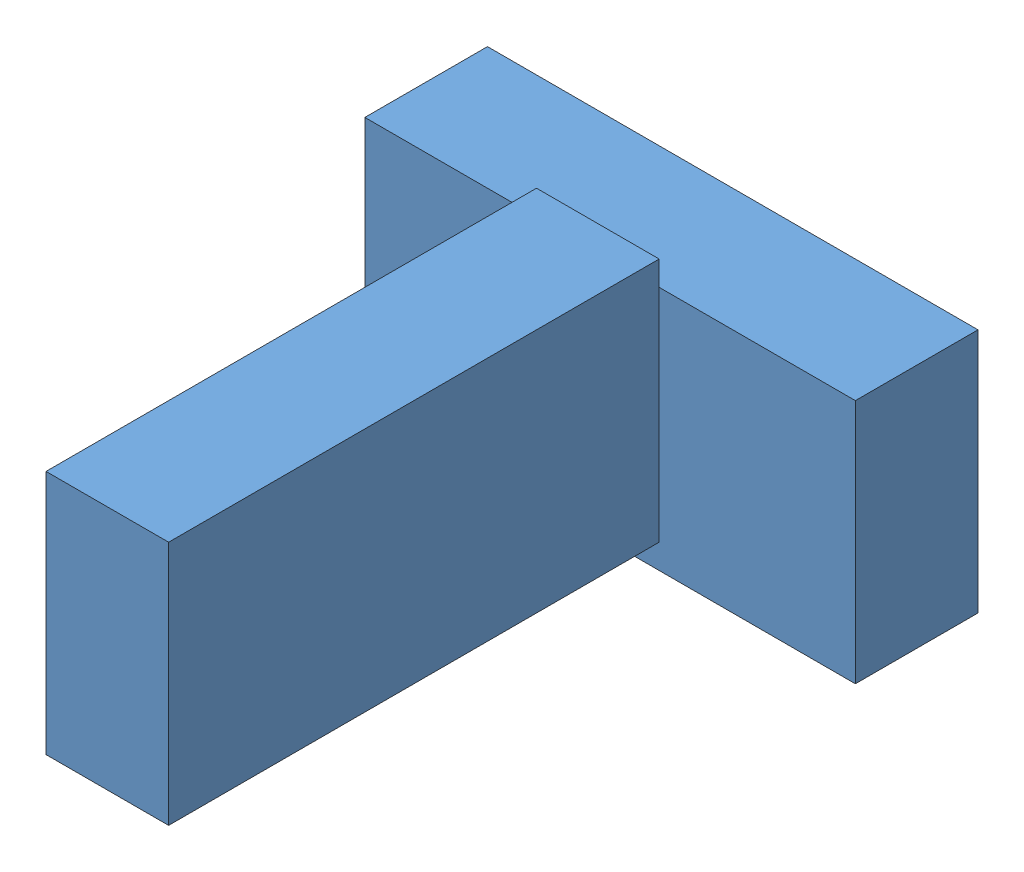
SolidWorks assembly Baugruppe2.SLDASM, configuration mit Umrisse (file format 3400). Lengths in mm.
Overall size (200 110 250).
2 component instances, 1 part files, 3 mates.
Components (placement in the parent):
- Teil3-1: Teil3.SLDPRT [Standard] at origin size (200 100 50)
- Teil3-2: Teil3.SLDPRT [Standard] at (20 10 150) x (0 0 1) z (-1 0 0) size (200 100 50)
Mates (geometry in assembly coordinates):
- Deckungsgleich1: coincident anti-aligned: plane of Teil3-1 through (-100 -50 50) normal (0 0 1); plane of Teil3-2 through (-30 60 50) normal (0 0 -1)
- Abstand1: distance = 10 mm aligned: plane of Teil3-1 through (-100 -50 50) normal (0 -1 0); plane of Teil3-2 through (-30 -40 50) normal (0 -1 0)
- Abstand2: distance = 80 mm aligned: plane of Teil3-1 through (100 50 50) normal (1 0 0); plane of Teil3-2 through (20 -40 50) normal (1 0 0)
